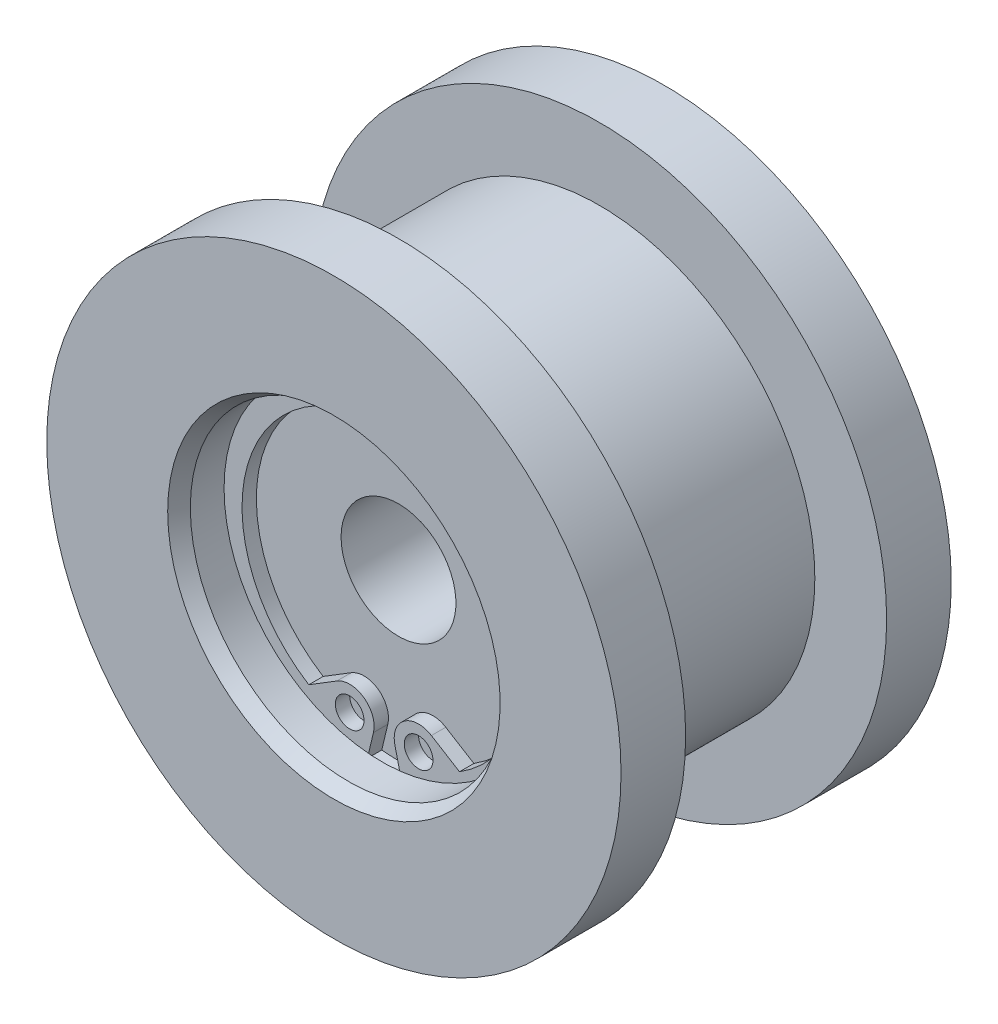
ISO-10303-21;
HEADER;
FILE_DESCRIPTION(('STEP AP214'),'2;1');
FILE_NAME('part.step','',(''),(''),'','','');
FILE_SCHEMA(('AUTOMOTIVE_DESIGN { 1 0 10303 214 1 1 1 1 }'));
ENDSEC;
DATA;
#1=APPLICATION_CONTEXT('core data for automotive mechanical design processes');
#2=APPLICATION_PROTOCOL_DEFINITION('international standard','automotive_design',2000,#1);
#3=PRODUCT_CONTEXT('',#1,'mechanical');
#4=PRODUCT('Part','Part','',(#3));
#5=PRODUCT_RELATED_PRODUCT_CATEGORY('part','',(#4));
#6=PRODUCT_DEFINITION_FORMATION('','',#4);
#7=PRODUCT_DEFINITION_CONTEXT('part definition',#1,'design');
#8=PRODUCT_DEFINITION('design','',#6,#7);
#9=PRODUCT_DEFINITION_SHAPE('','',#8);
#10=(LENGTH_UNIT() NAMED_UNIT(*) SI_UNIT(.MILLI.,.METRE.));
#11=(NAMED_UNIT(*) PLANE_ANGLE_UNIT() SI_UNIT($,.RADIAN.));
#12=(NAMED_UNIT(*) SI_UNIT($,.STERADIAN.) SOLID_ANGLE_UNIT());
#13=UNCERTAINTY_MEASURE_WITH_UNIT(LENGTH_MEASURE(1.E-05),#10,'distance_accuracy_value','');
#14=(GEOMETRIC_REPRESENTATION_CONTEXT(3) GLOBAL_UNCERTAINTY_ASSIGNED_CONTEXT((#13)) GLOBAL_UNIT_ASSIGNED_CONTEXT((#10,
#11,#12)) REPRESENTATION_CONTEXT('',''));
#15=CARTESIAN_POINT('',(0.,0.,0.));
#16=DIRECTION('',(0.,0.,1.));
#17=DIRECTION('',(1.,0.,0.));
#18=AXIS2_PLACEMENT_3D('',#15,#16,#17);
#19=CARTESIAN_POINT('',(0.,4.,7.));
#20=DIRECTION('',(0.,0.,1.));
#21=DIRECTION('',(1.,0.,0.));
#22=AXIS2_PLACEMENT_3D('',#19,#20,#21);
#23=PLANE('',#22);
#24=CARTESIAN_POINT('',(2.4,-9.28614557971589,7.));
#25=DIRECTION('',(0.,0.,1.));
#26=DIRECTION('',(1.,0.,0.));
#27=AXIS2_PLACEMENT_3D('',#24,#25,#26);
#28=CIRCLE('',#27,1.);
#29=CARTESIAN_POINT('',(3.4,-9.28614557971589,7.));
#30=VERTEX_POINT('',#29);
#31=EDGE_CURVE('E571',#30,#30,#28,.T.);
#32=ORIENTED_EDGE('',*,*,#31,.T.);
#33=EDGE_LOOP('',(#32));
#34=FACE_BOUND('',#33,.T.);
#35=ADVANCED_FACE('F14',(#34),#23,.T.);
#36=CARTESIAN_POINT('',(-2.4,-9.28614557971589,7.));
#37=DIRECTION('',(0.,0.,-1.));
#38=DIRECTION('',(1.,0.,0.));
#39=AXIS2_PLACEMENT_3D('',#36,#37,#38);
#40=CIRCLE('',#39,1.);
#41=CARTESIAN_POINT('',(-1.4,-9.28614557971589,7.));
#42=VERTEX_POINT('',#41);
#43=EDGE_CURVE('E130',#42,#42,#40,.T.);
#44=ORIENTED_EDGE('',*,*,#43,.F.);
#45=EDGE_LOOP('',(#44));
#46=FACE_BOUND('',#45,.T.);
#47=ADVANCED_FACE('F204',(#46),#23,.T.);
#48=CARTESIAN_POINT('',(0.,0.,-11.5));
#49=DIRECTION('',(0.,0.,-1.));
#50=DIRECTION('',(-1.,0.,0.));
#51=AXIS2_PLACEMENT_3D('',#48,#49,#50);
#52=CYLINDRICAL_SURFACE('',#51,15.);
#53=CARTESIAN_POINT('',(0.,0.,7.));
#54=DIRECTION('',(0.,0.,-1.));
#55=DIRECTION('',(-1.,0.,0.));
#56=AXIS2_PLACEMENT_3D('',#53,#54,#55);
#57=CIRCLE('',#56,15.);
#58=CARTESIAN_POINT('',(-15.,0.,7.));
#59=VERTEX_POINT('',#58);
#60=EDGE_CURVE('E176',#59,#59,#57,.T.);
#61=ORIENTED_EDGE('',*,*,#60,.T.);
#62=EDGE_LOOP('',(#61));
#63=FACE_BOUND('',#62,.T.);
#64=CARTESIAN_POINT('',(0.,0.,-7.));
#65=DIRECTION('',(0.,0.,-1.));
#66=DIRECTION('',(-1.,0.,0.));
#67=AXIS2_PLACEMENT_3D('',#64,#65,#66);
#68=CIRCLE('',#67,15.);
#69=CARTESIAN_POINT('',(-15.,0.,-7.));
#70=VERTEX_POINT('',#69);
#71=EDGE_CURVE('E179',#70,#70,#68,.T.);
#72=ORIENTED_EDGE('',*,*,#71,.F.);
#73=EDGE_LOOP('',(#72));
#74=FACE_BOUND('',#73,.T.);
#75=ADVANCED_FACE('F199',(#63,#74),#52,.T.);
#76=CARTESIAN_POINT('',(0.,15.,7.));
#77=DIRECTION('',(0.,0.,-1.));
#78=DIRECTION('',(-1.,0.,0.));
#79=AXIS2_PLACEMENT_3D('',#76,#77,#78);
#80=PLANE('',#79);
#81=CARTESIAN_POINT('',(0.,0.,7.));
#82=DIRECTION('',(0.,0.,-1.));
#83=DIRECTION('',(-1.,0.,0.));
#84=AXIS2_PLACEMENT_3D('',#81,#82,#83);
#85=CIRCLE('',#84,20.);
#86=CARTESIAN_POINT('',(-20.,0.,7.));
#87=VERTEX_POINT('',#86);
#88=EDGE_CURVE('E173',#87,#87,#85,.T.);
#89=ORIENTED_EDGE('',*,*,#88,.T.);
#90=EDGE_LOOP('',(#89));
#91=FACE_BOUND('',#90,.T.);
#92=ORIENTED_EDGE('',*,*,#60,.F.);
#93=EDGE_LOOP('',(#92));
#94=FACE_BOUND('',#93,.T.);
#95=ADVANCED_FACE('F190',(#91,#94),#80,.T.);
#96=CARTESIAN_POINT('',(0.,20.,-7.));
#97=DIRECTION('',(0.,0.,1.));
#98=DIRECTION('',(1.,0.,0.));
#99=AXIS2_PLACEMENT_3D('',#96,#97,#98);
#100=PLANE('',#99);
#101=ORIENTED_EDGE('',*,*,#71,.T.);
#102=EDGE_LOOP('',(#101));
#103=FACE_BOUND('',#102,.T.);
#104=CARTESIAN_POINT('',(0.,0.,-7.));
#105=DIRECTION('',(0.,0.,-1.));
#106=DIRECTION('',(-1.,0.,0.));
#107=AXIS2_PLACEMENT_3D('',#104,#105,#106);
#108=CIRCLE('',#107,20.);
#109=CARTESIAN_POINT('',(-20.,0.,-7.));
#110=VERTEX_POINT('',#109);
#111=EDGE_CURVE('E131',#110,#110,#108,.T.);
#112=ORIENTED_EDGE('',*,*,#111,.F.);
#113=EDGE_LOOP('',(#112));
#114=FACE_BOUND('',#113,.T.);
#115=ADVANCED_FACE('F187',(#103,#114),#100,.T.);
#116=CARTESIAN_POINT('',(0.,0.,-11.5));
#117=DIRECTION('',(0.,0.,-1.));
#118=DIRECTION('',(-1.,0.,0.));
#119=AXIS2_PLACEMENT_3D('',#116,#117,#118);
#120=CYLINDRICAL_SURFACE('',#119,20.);
#121=CARTESIAN_POINT('',(0.,0.,11.5));
#122=DIRECTION('',(0.,0.,-1.));
#123=DIRECTION('',(-1.,0.,0.));
#124=AXIS2_PLACEMENT_3D('',#121,#122,#123);
#125=CIRCLE('',#124,20.);
#126=CARTESIAN_POINT('',(-20.,0.,11.5));
#127=VERTEX_POINT('',#126);
#128=EDGE_CURVE('E170',#127,#127,#125,.T.);
#129=ORIENTED_EDGE('',*,*,#128,.T.);
#130=EDGE_LOOP('',(#129));
#131=FACE_BOUND('',#130,.T.);
#132=ORIENTED_EDGE('',*,*,#88,.F.);
#133=EDGE_LOOP('',(#132));
#134=FACE_BOUND('',#133,.T.);
#135=ADVANCED_FACE('F189',(#131,#134),#120,.T.);
#136=CARTESIAN_POINT('',(0.,0.,-11.5));
#137=DIRECTION('',(0.,0.,-1.));
#138=DIRECTION('',(-1.,0.,0.));
#139=AXIS2_PLACEMENT_3D('',#136,#137,#138);
#140=CYLINDRICAL_SURFACE('',#139,20.);
#141=ORIENTED_EDGE('',*,*,#111,.T.);
#142=EDGE_LOOP('',(#141));
#143=FACE_BOUND('',#142,.T.);
#144=CARTESIAN_POINT('',(0.,0.,-11.5));
#145=DIRECTION('',(0.,0.,-1.));
#146=DIRECTION('',(-1.,0.,0.));
#147=AXIS2_PLACEMENT_3D('',#144,#145,#146);
#148=CIRCLE('',#147,20.);
#149=CARTESIAN_POINT('',(-20.,0.,-11.5));
#150=VERTEX_POINT('',#149);
#151=EDGE_CURVE('E142',#150,#150,#148,.T.);
#152=ORIENTED_EDGE('',*,*,#151,.F.);
#153=EDGE_LOOP('',(#152));
#154=FACE_BOUND('',#153,.T.);
#155=ADVANCED_FACE('F16',(#143,#154),#140,.T.);
#156=CARTESIAN_POINT('',(0.,20.,11.5));
#157=DIRECTION('',(0.,0.,1.));
#158=DIRECTION('',(1.,0.,0.));
#159=AXIS2_PLACEMENT_3D('',#156,#157,#158);
#160=PLANE('',#159);
#161=CARTESIAN_POINT('',(0.,0.,11.5));
#162=DIRECTION('',(0.,0.,-1.));
#163=DIRECTION('',(-1.,0.,0.));
#164=AXIS2_PLACEMENT_3D('',#161,#162,#163);
#165=CIRCLE('',#164,11.5773502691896);
#166=CARTESIAN_POINT('',(-11.5773502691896,0.,11.5));
#167=VERTEX_POINT('',#166);
#168=EDGE_CURVE('E167',#167,#167,#165,.T.);
#169=ORIENTED_EDGE('',*,*,#168,.T.);
#170=EDGE_LOOP('',(#169));
#171=FACE_BOUND('',#170,.T.);
#172=ORIENTED_EDGE('',*,*,#128,.F.);
#173=EDGE_LOOP('',(#172));
#174=FACE_BOUND('',#173,.T.);
#175=ADVANCED_FACE('F260',(#171,#174),#160,.T.);
#176=CARTESIAN_POINT('',(0.,9.,-11.5));
#177=DIRECTION('',(0.,0.,-1.));
#178=DIRECTION('',(-1.,0.,0.));
#179=AXIS2_PLACEMENT_3D('',#176,#177,#178);
#180=PLANE('',#179);
#181=ORIENTED_EDGE('',*,*,#151,.T.);
#182=EDGE_LOOP('',(#181));
#183=FACE_BOUND('',#182,.T.);
#184=CARTESIAN_POINT('',(0.,0.,-11.5));
#185=DIRECTION('',(0.,0.,-1.));
#186=DIRECTION('',(-1.,0.,0.));
#187=AXIS2_PLACEMENT_3D('',#184,#185,#186);
#188=CIRCLE('',#187,9.);
#189=CARTESIAN_POINT('',(-9.,0.,-11.5));
#190=VERTEX_POINT('',#189);
#191=EDGE_CURVE('E145',#190,#190,#188,.T.);
#192=ORIENTED_EDGE('',*,*,#191,.F.);
#193=EDGE_LOOP('',(#192));
#194=FACE_BOUND('',#193,.T.);
#195=ADVANCED_FACE('F256',(#183,#194),#180,.T.);
#196=CARTESIAN_POINT('',(0.,0.,11.5));
#197=DIRECTION('',(0.,0.,1.));
#198=DIRECTION('',(1.,0.,0.));
#199=AXIS2_PLACEMENT_3D('',#196,#197,#198);
#200=CONICAL_SURFACE('',#199,11.5773502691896,0.523598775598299);
#201=CARTESIAN_POINT('',(0.,0.,10.5));
#202=DIRECTION('',(0.,0.,-1.));
#203=DIRECTION('',(-1.,0.,0.));
#204=AXIS2_PLACEMENT_3D('',#201,#202,#203);
#205=CIRCLE('',#204,11.);
#206=CARTESIAN_POINT('',(-11.,0.,10.5));
#207=VERTEX_POINT('',#206);
#208=EDGE_CURVE('E164',#207,#207,#205,.T.);
#209=ORIENTED_EDGE('',*,*,#208,.T.);
#210=EDGE_LOOP('',(#209));
#211=FACE_BOUND('',#210,.T.);
#212=ORIENTED_EDGE('',*,*,#168,.F.);
#213=EDGE_LOOP('',(#212));
#214=FACE_BOUND('',#213,.T.);
#215=ADVANCED_FACE('F259',(#211,#214),#200,.F.);
#216=CARTESIAN_POINT('',(0.,0.,-11.5));
#217=DIRECTION('',(0.,0.,-1.));
#218=DIRECTION('',(-1.,0.,0.));
#219=AXIS2_PLACEMENT_3D('',#216,#217,#218);
#220=CYLINDRICAL_SURFACE('',#219,9.);
#221=ORIENTED_EDGE('',*,*,#191,.T.);
#222=EDGE_LOOP('',(#221));
#223=FACE_BOUND('',#222,.T.);
#224=CARTESIAN_POINT('',(0.,0.,-7.));
#225=DIRECTION('',(0.,0.,-1.));
#226=DIRECTION('',(-1.,0.,0.));
#227=AXIS2_PLACEMENT_3D('',#224,#225,#226);
#228=CIRCLE('',#227,9.);
#229=CARTESIAN_POINT('',(-9.,0.,-7.));
#230=VERTEX_POINT('',#229);
#231=EDGE_CURVE('E148',#230,#230,#228,.T.);
#232=ORIENTED_EDGE('',*,*,#231,.F.);
#233=EDGE_LOOP('',(#232));
#234=FACE_BOUND('',#233,.T.);
#235=ADVANCED_FACE('F262',(#223,#234),#220,.F.);
#236=CARTESIAN_POINT('',(0.,0.,-11.5));
#237=DIRECTION('',(0.,0.,-1.));
#238=DIRECTION('',(-1.,0.,0.));
#239=AXIS2_PLACEMENT_3D('',#236,#237,#238);
#240=CYLINDRICAL_SURFACE('',#239,11.);
#241=CARTESIAN_POINT('',(0.,0.,8.15));
#242=DIRECTION('',(0.,0.,-1.));
#243=DIRECTION('',(-1.,0.,0.));
#244=AXIS2_PLACEMENT_3D('',#241,#242,#243);
#245=CIRCLE('',#244,11.);
#246=CARTESIAN_POINT('',(-11.,0.,8.15));
#247=VERTEX_POINT('',#246);
#248=EDGE_CURVE('E161',#247,#247,#245,.T.);
#249=ORIENTED_EDGE('',*,*,#248,.T.);
#250=EDGE_LOOP('',(#249));
#251=FACE_BOUND('',#250,.T.);
#252=ORIENTED_EDGE('',*,*,#208,.F.);
#253=EDGE_LOOP('',(#252));
#254=FACE_BOUND('',#253,.T.);
#255=ADVANCED_FACE('F265',(#251,#254),#240,.F.);
#256=CARTESIAN_POINT('',(0.,9.,-7.));
#257=DIRECTION('',(0.,0.,-1.));
#258=DIRECTION('',(-1.,0.,0.));
#259=AXIS2_PLACEMENT_3D('',#256,#257,#258);
#260=PLANE('',#259);
#261=ORIENTED_EDGE('',*,*,#231,.T.);
#262=EDGE_LOOP('',(#261));
#263=FACE_BOUND('',#262,.T.);
#264=CARTESIAN_POINT('',(0.,0.,-7.));
#265=DIRECTION('',(0.,0.,-1.));
#266=DIRECTION('',(-1.,0.,0.));
#267=AXIS2_PLACEMENT_3D('',#264,#265,#266);
#268=CIRCLE('',#267,4.);
#269=CARTESIAN_POINT('',(-4.,0.,-7.));
#270=VERTEX_POINT('',#269);
#271=EDGE_CURVE('E151',#270,#270,#268,.T.);
#272=ORIENTED_EDGE('',*,*,#271,.F.);
#273=EDGE_LOOP('',(#272));
#274=FACE_BOUND('',#273,.T.);
#275=ADVANCED_FACE('F267',(#263,#274),#260,.T.);
#276=CARTESIAN_POINT('',(0.,11.5,8.15));
#277=DIRECTION('',(0.,0.,-1.));
#278=DIRECTION('',(-1.,0.,0.));
#279=AXIS2_PLACEMENT_3D('',#276,#277,#278);
#280=PLANE('',#279);
#281=CARTESIAN_POINT('',(0.,0.,8.15));
#282=DIRECTION('',(0.,0.,-1.));
#283=DIRECTION('',(-1.,0.,0.));
#284=AXIS2_PLACEMENT_3D('',#281,#282,#283);
#285=CIRCLE('',#284,11.5);
#286=CARTESIAN_POINT('',(-11.5,0.,8.15));
#287=VERTEX_POINT('',#286);
#288=EDGE_CURVE('E158',#287,#287,#285,.T.);
#289=ORIENTED_EDGE('',*,*,#288,.T.);
#290=EDGE_LOOP('',(#289));
#291=FACE_BOUND('',#290,.T.);
#292=ORIENTED_EDGE('',*,*,#248,.F.);
#293=EDGE_LOOP('',(#292));
#294=FACE_BOUND('',#293,.T.);
#295=ADVANCED_FACE('F269',(#291,#294),#280,.T.);
#296=CARTESIAN_POINT('',(0.,0.,-11.5));
#297=DIRECTION('',(0.,0.,-1.));
#298=DIRECTION('',(-1.,0.,0.));
#299=AXIS2_PLACEMENT_3D('',#296,#297,#298);
#300=CYLINDRICAL_SURFACE('',#299,11.5);
#301=ORIENTED_EDGE('',*,*,#288,.F.);
#302=EDGE_LOOP('',(#301));
#303=FACE_BOUND('',#302,.T.);
#304=DIRECTION('',(0.,0.,-1.));
#305=VECTOR('',#304,1.);
#306=CARTESIAN_POINT('',(1.16498191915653,-11.440839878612,-11.5));
#307=LINE('',#306,#305);
#308=CARTESIAN_POINT('',(1.16498191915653,-11.440839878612,7.));
#309=VERTEX_POINT('',#308);
#310=CARTESIAN_POINT('',(1.16498191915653,-11.440839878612,8.));
#311=VERTEX_POINT('',#310);
#312=EDGE_CURVE('E18',#309,#311,#307,.F.);
#313=ORIENTED_EDGE('',*,*,#312,.F.);
#314=CARTESIAN_POINT('',(0.,0.,7.));
#315=DIRECTION('',(0.,0.,-1.));
#316=DIRECTION('',(-1.,0.,0.));
#317=AXIS2_PLACEMENT_3D('',#314,#315,#316);
#318=CIRCLE('',#317,11.5);
#319=CARTESIAN_POINT('',(-1.16498191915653,-11.440839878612,7.));
#320=VERTEX_POINT('',#319);
#321=EDGE_CURVE('E107',#309,#320,#318,.T.);
#322=ORIENTED_EDGE('',*,*,#321,.T.);
#323=DIRECTION('',(0.,0.,-1.));
#324=VECTOR('',#323,1.);
#325=CARTESIAN_POINT('',(-1.16498191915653,-11.440839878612,-11.5));
#326=LINE('',#325,#324);
#327=CARTESIAN_POINT('',(-1.16498191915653,-11.440839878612,8.));
#328=VERTEX_POINT('',#327);
#329=EDGE_CURVE('E138',#328,#320,#326,.T.);
#330=ORIENTED_EDGE('',*,*,#329,.F.);
#331=CARTESIAN_POINT('',(0.,0.,8.));
#332=DIRECTION('',(0.,0.,-1.));
#333=DIRECTION('',(-1.,0.,0.));
#334=AXIS2_PLACEMENT_3D('',#331,#332,#333);
#335=CIRCLE('',#334,11.5);
#336=EDGE_CURVE('E9',#311,#328,#335,.F.);
#337=ORIENTED_EDGE('',*,*,#336,.F.);
#338=EDGE_LOOP('',(#313,#322,#330,#337));
#339=FACE_BOUND('',#338,.T.);
#340=ADVANCED_FACE('F272',(#303,#339),#300,.F.);
#341=CARTESIAN_POINT('',(0.,0.,-11.5));
#342=DIRECTION('',(0.,0.,-1.));
#343=DIRECTION('',(-1.,0.,0.));
#344=AXIS2_PLACEMENT_3D('',#341,#342,#343);
#345=CYLINDRICAL_SURFACE('',#344,4.);
#346=ORIENTED_EDGE('',*,*,#271,.T.);
#347=EDGE_LOOP('',(#346));
#348=FACE_BOUND('',#347,.T.);
#349=CARTESIAN_POINT('',(0.,0.,7.));
#350=DIRECTION('',(0.,0.,-1.));
#351=DIRECTION('',(-1.,0.,0.));
#352=AXIS2_PLACEMENT_3D('',#349,#350,#351);
#353=CIRCLE('',#352,4.);
#354=CARTESIAN_POINT('',(-4.,0.,7.));
#355=VERTEX_POINT('',#354);
#356=EDGE_CURVE('E154',#355,#355,#353,.T.);
#357=ORIENTED_EDGE('',*,*,#356,.F.);
#358=EDGE_LOOP('',(#357));
#359=FACE_BOUND('',#358,.T.);
#360=ADVANCED_FACE('F216',(#348,#359),#345,.F.);
#361=ORIENTED_EDGE('',*,*,#356,.T.);
#362=EDGE_LOOP('',(#361));
#363=FACE_BOUND('',#362,.T.);
#364=DIRECTION('',(0.231349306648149,-0.972870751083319,0.));
#365=VECTOR('',#364,1.);
#366=CARTESIAN_POINT('',(0.746119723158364,-9.67943940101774,7.));
#367=LINE('',#366,#365);
#368=CARTESIAN_POINT('',(0.746119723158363,-9.67943940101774,7.));
#369=VERTEX_POINT('',#368);
#370=EDGE_CURVE('E34',#369,#309,#367,.T.);
#371=ORIENTED_EDGE('',*,*,#370,.F.);
#372=CARTESIAN_POINT('',(2.4,-9.28614557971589,7.));
#373=DIRECTION('',(0.,0.,1.));
#374=DIRECTION('',(1.,0.,0.));
#375=AXIS2_PLACEMENT_3D('',#372,#373,#374);
#376=CIRCLE('',#375,1.7);
#377=CARTESIAN_POINT('',(3.29136923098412,-7.83857489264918,7.));
#378=VERTEX_POINT('',#377);
#379=EDGE_CURVE('E94',#378,#369,#376,.T.);
#380=ORIENTED_EDGE('',*,*,#379,.F.);
#381=DIRECTION('',(-0.851512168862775,0.524334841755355,0.));
#382=VECTOR('',#381,1.);
#383=CARTESIAN_POINT('',(3.29136923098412,-7.83857489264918,7.));
#384=LINE('',#383,#382);
#385=CARTESIAN_POINT('',(5.2489218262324,-9.04397520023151,7.));
#386=VERTEX_POINT('',#385);
#387=EDGE_CURVE('E136',#386,#378,#384,.T.);
#388=ORIENTED_EDGE('',*,*,#387,.F.);
#389=CARTESIAN_POINT('',(0.,-0.65,7.));
#390=DIRECTION('',(0.,0.,-1.));
#391=DIRECTION('',(0.,-1.,0.));
#392=AXIS2_PLACEMENT_3D('',#389,#390,#391);
#393=CIRCLE('',#392,9.9);
#394=CARTESIAN_POINT('',(-5.24892182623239,-9.04397520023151,7.));
#395=VERTEX_POINT('',#394);
#396=EDGE_CURVE('E575',#395,#386,#393,.T.);
#397=ORIENTED_EDGE('',*,*,#396,.F.);
#398=DIRECTION('',(-0.851512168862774,-0.524334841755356,0.));
#399=VECTOR('',#398,1.);
#400=CARTESIAN_POINT('',(-3.29136923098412,-7.83857489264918,7.));
#401=LINE('',#400,#399);
#402=CARTESIAN_POINT('',(-3.29136923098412,-7.83857489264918,7.));
#403=VERTEX_POINT('',#402);
#404=EDGE_CURVE('E141',#403,#395,#401,.T.);
#405=ORIENTED_EDGE('',*,*,#404,.F.);
#406=CARTESIAN_POINT('',(-2.4,-9.28614557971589,7.));
#407=DIRECTION('',(0.,0.,1.));
#408=DIRECTION('',(-1.,0.,0.));
#409=AXIS2_PLACEMENT_3D('',#406,#407,#408);
#410=CIRCLE('',#409,1.7);
#411=CARTESIAN_POINT('',(-0.746119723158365,-9.67943940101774,7.));
#412=VERTEX_POINT('',#411);
#413=EDGE_CURVE('E121',#412,#403,#410,.T.);
#414=ORIENTED_EDGE('',*,*,#413,.F.);
#415=DIRECTION('',(0.231349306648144,0.97287075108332,0.));
#416=VECTOR('',#415,1.);
#417=CARTESIAN_POINT('',(-0.746119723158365,-9.67943940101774,7.));
#418=LINE('',#417,#416);
#419=EDGE_CURVE('E115',#320,#412,#418,.T.);
#420=ORIENTED_EDGE('',*,*,#419,.F.);
#421=ORIENTED_EDGE('',*,*,#321,.F.);
#422=EDGE_LOOP('',(#371,#380,#388,#397,#405,#414,#420,#421));
#423=FACE_BOUND('',#422,.T.);
#424=ADVANCED_FACE('F105',(#363,#423),#23,.T.);
#425=CARTESIAN_POINT('',(0.,-0.65,8.));
#426=DIRECTION('',(0.,0.,1.));
#427=DIRECTION('',(-1.,0.,0.));
#428=AXIS2_PLACEMENT_3D('',#425,#426,#427);
#429=CYLINDRICAL_SURFACE('',#428,9.9);
#430=ORIENTED_EDGE('',*,*,#396,.T.);
#431=DIRECTION('',(0.,0.,-1.));
#432=VECTOR('',#431,1.);
#433=CARTESIAN_POINT('',(5.2489218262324,-9.04397520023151,8.));
#434=LINE('',#433,#432);
#435=CARTESIAN_POINT('',(5.2489218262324,-9.04397520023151,8.));
#436=VERTEX_POINT('',#435);
#437=EDGE_CURVE('E132',#436,#386,#434,.T.);
#438=ORIENTED_EDGE('',*,*,#437,.F.);
#439=CARTESIAN_POINT('',(0.,-0.65,8.));
#440=DIRECTION('',(0.,0.,-1.));
#441=DIRECTION('',(0.,-1.,0.));
#442=AXIS2_PLACEMENT_3D('',#439,#440,#441);
#443=CIRCLE('',#442,9.9);
#444=CARTESIAN_POINT('',(-5.24892182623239,-9.04397520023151,8.));
#445=VERTEX_POINT('',#444);
#446=EDGE_CURVE('E549',#445,#436,#443,.T.);
#447=ORIENTED_EDGE('',*,*,#446,.F.);
#448=DIRECTION('',(0.,0.,-1.));
#449=VECTOR('',#448,1.);
#450=CARTESIAN_POINT('',(-5.24892182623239,-9.04397520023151,8.));
#451=LINE('',#450,#449);
#452=EDGE_CURVE('E125',#445,#395,#451,.T.);
#453=ORIENTED_EDGE('',*,*,#452,.T.);
#454=EDGE_LOOP('',(#430,#438,#447,#453));
#455=FACE_BOUND('',#454,.T.);
#456=ADVANCED_FACE('F207',(#455),#429,.F.);
#457=CARTESIAN_POINT('',(3.29136923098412,-7.83857489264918,8.));
#458=DIRECTION('',(-0.524334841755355,-0.851512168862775,0.));
#459=DIRECTION('',(-0.851512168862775,0.524334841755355,0.));
#460=AXIS2_PLACEMENT_3D('',#457,#458,#459);
#461=PLANE('',#460);
#462=ORIENTED_EDGE('',*,*,#387,.T.);
#463=DIRECTION('',(0.,0.,-1.));
#464=VECTOR('',#463,1.);
#465=CARTESIAN_POINT('',(3.29136923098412,-7.83857489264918,8.));
#466=LINE('',#465,#464);
#467=CARTESIAN_POINT('',(3.29136923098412,-7.83857489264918,8.));
#468=VERTEX_POINT('',#467);
#469=EDGE_CURVE('E98',#468,#378,#466,.T.);
#470=ORIENTED_EDGE('',*,*,#469,.F.);
#471=DIRECTION('',(-0.851512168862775,0.524334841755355,0.));
#472=VECTOR('',#471,1.);
#473=CARTESIAN_POINT('',(3.29136923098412,-7.83857489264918,8.));
#474=LINE('',#473,#472);
#475=EDGE_CURVE('E552',#436,#468,#474,.T.);
#476=ORIENTED_EDGE('',*,*,#475,.F.);
#477=ORIENTED_EDGE('',*,*,#437,.T.);
#478=EDGE_LOOP('',(#462,#470,#476,#477));
#479=FACE_BOUND('',#478,.T.);
#480=ADVANCED_FACE('F219',(#479),#461,.F.);
#481=CARTESIAN_POINT('',(2.4,-9.28614557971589,8.));
#482=DIRECTION('',(0.,0.,1.));
#483=DIRECTION('',(-1.,0.,0.));
#484=AXIS2_PLACEMENT_3D('',#481,#482,#483);
#485=CYLINDRICAL_SURFACE('',#484,1.7);
#486=ORIENTED_EDGE('',*,*,#379,.T.);
#487=DIRECTION('',(0.,0.,-1.));
#488=VECTOR('',#487,1.);
#489=CARTESIAN_POINT('',(0.746119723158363,-9.67943940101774,8.));
#490=LINE('',#489,#488);
#491=CARTESIAN_POINT('',(0.746119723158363,-9.67943940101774,8.));
#492=VERTEX_POINT('',#491);
#493=EDGE_CURVE('E97',#492,#369,#490,.T.);
#494=ORIENTED_EDGE('',*,*,#493,.F.);
#495=CARTESIAN_POINT('',(2.4,-9.28614557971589,8.));
#496=DIRECTION('',(0.,0.,1.));
#497=DIRECTION('',(1.,0.,0.));
#498=AXIS2_PLACEMENT_3D('',#495,#496,#497);
#499=CIRCLE('',#498,1.7);
#500=EDGE_CURVE('E537',#468,#492,#499,.T.);
#501=ORIENTED_EDGE('',*,*,#500,.F.);
#502=ORIENTED_EDGE('',*,*,#469,.T.);
#503=EDGE_LOOP('',(#486,#494,#501,#502));
#504=FACE_BOUND('',#503,.T.);
#505=ADVANCED_FACE('F95',(#504),#485,.T.);
#506=CARTESIAN_POINT('',(-0.746119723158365,-9.67943940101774,8.));
#507=DIRECTION('',(-0.97287075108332,0.231349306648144,0.));
#508=DIRECTION('',(0.,0.,1.));
#509=AXIS2_PLACEMENT_3D('',#506,#507,#508);
#510=PLANE('',#509);
#511=DIRECTION('',(0.231349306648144,0.97287075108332,0.));
#512=VECTOR('',#511,1.);
#513=CARTESIAN_POINT('',(-0.746119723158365,-9.67943940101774,8.));
#514=LINE('',#513,#512);
#515=CARTESIAN_POINT('',(-0.746119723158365,-9.67943940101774,8.));
#516=VERTEX_POINT('',#515);
#517=EDGE_CURVE('E480',#328,#516,#514,.T.);
#518=ORIENTED_EDGE('',*,*,#517,.F.);
#519=ORIENTED_EDGE('',*,*,#329,.T.);
#520=ORIENTED_EDGE('',*,*,#419,.T.);
#521=DIRECTION('',(0.,0.,-1.));
#522=VECTOR('',#521,1.);
#523=CARTESIAN_POINT('',(-0.746119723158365,-9.67943940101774,8.));
#524=LINE('',#523,#522);
#525=EDGE_CURVE('E556',#516,#412,#524,.T.);
#526=ORIENTED_EDGE('',*,*,#525,.F.);
#527=EDGE_LOOP('',(#518,#519,#520,#526));
#528=FACE_BOUND('',#527,.T.);
#529=ADVANCED_FACE('F244',(#528),#510,.F.);
#530=CARTESIAN_POINT('',(0.,-0.65,8.));
#531=DIRECTION('',(0.,0.,-1.));
#532=DIRECTION('',(0.,-1.,0.));
#533=AXIS2_PLACEMENT_3D('',#530,#531,#532);
#534=PLANE('',#533);
#535=CARTESIAN_POINT('',(-2.4,-9.28614557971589,8.));
#536=DIRECTION('',(0.,0.,-1.));
#537=DIRECTION('',(1.,0.,0.));
#538=AXIS2_PLACEMENT_3D('',#535,#536,#537);
#539=CIRCLE('',#538,1.);
#540=CARTESIAN_POINT('',(-1.4,-9.28614557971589,8.));
#541=VERTEX_POINT('',#540);
#542=EDGE_CURVE('E102',#541,#541,#539,.T.);
#543=ORIENTED_EDGE('',*,*,#542,.T.);
#544=EDGE_LOOP('',(#543));
#545=FACE_BOUND('',#544,.T.);
#546=CARTESIAN_POINT('',(2.4,-9.28614557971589,8.));
#547=DIRECTION('',(0.,0.,1.));
#548=DIRECTION('',(1.,0.,0.));
#549=AXIS2_PLACEMENT_3D('',#546,#547,#548);
#550=CIRCLE('',#549,1.);
#551=CARTESIAN_POINT('',(3.4,-9.28614557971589,8.));
#552=VERTEX_POINT('',#551);
#553=EDGE_CURVE('E127',#552,#552,#550,.T.);
#554=ORIENTED_EDGE('',*,*,#553,.F.);
#555=EDGE_LOOP('',(#554));
#556=FACE_BOUND('',#555,.T.);
#557=DIRECTION('',(0.231349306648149,-0.972870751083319,0.));
#558=VECTOR('',#557,1.);
#559=CARTESIAN_POINT('',(0.746119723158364,-9.67943940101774,8.));
#560=LINE('',#559,#558);
#561=EDGE_CURVE('E112',#492,#311,#560,.T.);
#562=ORIENTED_EDGE('',*,*,#561,.T.);
#563=ORIENTED_EDGE('',*,*,#336,.T.);
#564=ORIENTED_EDGE('',*,*,#517,.T.);
#565=CARTESIAN_POINT('',(-2.4,-9.28614557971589,8.));
#566=DIRECTION('',(0.,0.,1.));
#567=DIRECTION('',(-1.,0.,0.));
#568=AXIS2_PLACEMENT_3D('',#565,#566,#567);
#569=CIRCLE('',#568,1.7);
#570=CARTESIAN_POINT('',(-3.29136923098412,-7.83857489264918,8.));
#571=VERTEX_POINT('',#570);
#572=EDGE_CURVE('E482',#516,#571,#569,.T.);
#573=ORIENTED_EDGE('',*,*,#572,.T.);
#574=DIRECTION('',(-0.851512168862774,-0.524334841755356,0.));
#575=VECTOR('',#574,1.);
#576=CARTESIAN_POINT('',(-3.29136923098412,-7.83857489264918,8.));
#577=LINE('',#576,#575);
#578=EDGE_CURVE('E137',#571,#445,#577,.T.);
#579=ORIENTED_EDGE('',*,*,#578,.T.);
#580=ORIENTED_EDGE('',*,*,#446,.T.);
#581=ORIENTED_EDGE('',*,*,#475,.T.);
#582=ORIENTED_EDGE('',*,*,#500,.T.);
#583=EDGE_LOOP('',(#562,#563,#564,#573,#579,#580,#581,#582));
#584=FACE_BOUND('',#583,.T.);
#585=ADVANCED_FACE('F236',(#545,#556,#584),#534,.F.);
#586=CARTESIAN_POINT('',(2.4,-9.28614557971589,8.));
#587=DIRECTION('',(0.,0.,1.));
#588=DIRECTION('',(-1.,0.,0.));
#589=AXIS2_PLACEMENT_3D('',#586,#587,#588);
#590=CYLINDRICAL_SURFACE('',#589,1.);
#591=ORIENTED_EDGE('',*,*,#31,.F.);
#592=EDGE_LOOP('',(#591));
#593=FACE_BOUND('',#592,.T.);
#594=ORIENTED_EDGE('',*,*,#553,.T.);
#595=EDGE_LOOP('',(#594));
#596=FACE_BOUND('',#595,.T.);
#597=ADVANCED_FACE('F232',(#593,#596),#590,.F.);
#598=CARTESIAN_POINT('',(-2.4,-9.28614557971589,8.));
#599=DIRECTION('',(0.,0.,1.));
#600=DIRECTION('',(-1.,0.,0.));
#601=AXIS2_PLACEMENT_3D('',#598,#599,#600);
#602=CYLINDRICAL_SURFACE('',#601,1.);
#603=ORIENTED_EDGE('',*,*,#43,.T.);
#604=EDGE_LOOP('',(#603));
#605=FACE_BOUND('',#604,.T.);
#606=ORIENTED_EDGE('',*,*,#542,.F.);
#607=EDGE_LOOP('',(#606));
#608=FACE_BOUND('',#607,.T.);
#609=ADVANCED_FACE('F228',(#605,#608),#602,.F.);
#610=CARTESIAN_POINT('',(-3.29136923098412,-7.83857489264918,8.));
#611=DIRECTION('',(0.524334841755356,-0.851512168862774,0.));
#612=DIRECTION('',(0.,0.,-1.));
#613=AXIS2_PLACEMENT_3D('',#610,#611,#612);
#614=PLANE('',#613);
#615=ORIENTED_EDGE('',*,*,#404,.T.);
#616=ORIENTED_EDGE('',*,*,#452,.F.);
#617=ORIENTED_EDGE('',*,*,#578,.F.);
#618=DIRECTION('',(0.,0.,-1.));
#619=VECTOR('',#618,1.);
#620=CARTESIAN_POINT('',(-3.29136923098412,-7.83857489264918,8.));
#621=LINE('',#620,#619);
#622=EDGE_CURVE('E564',#571,#403,#621,.T.);
#623=ORIENTED_EDGE('',*,*,#622,.T.);
#624=EDGE_LOOP('',(#615,#616,#617,#623));
#625=FACE_BOUND('',#624,.T.);
#626=ADVANCED_FACE('F231',(#625),#614,.F.);
#627=CARTESIAN_POINT('',(-2.4,-9.28614557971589,8.));
#628=DIRECTION('',(0.,0.,1.));
#629=DIRECTION('',(-1.,0.,0.));
#630=AXIS2_PLACEMENT_3D('',#627,#628,#629);
#631=CYLINDRICAL_SURFACE('',#630,1.7);
#632=ORIENTED_EDGE('',*,*,#413,.T.);
#633=ORIENTED_EDGE('',*,*,#622,.F.);
#634=ORIENTED_EDGE('',*,*,#572,.F.);
#635=ORIENTED_EDGE('',*,*,#525,.T.);
#636=EDGE_LOOP('',(#632,#633,#634,#635));
#637=FACE_BOUND('',#636,.T.);
#638=ADVANCED_FACE('F238',(#637),#631,.T.);
#639=CARTESIAN_POINT('',(0.746119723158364,-9.67943940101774,8.));
#640=DIRECTION('',(0.972870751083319,0.231349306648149,0.));
#641=DIRECTION('',(0.,0.,-1.));
#642=AXIS2_PLACEMENT_3D('',#639,#640,#641);
#643=PLANE('',#642);
#644=ORIENTED_EDGE('',*,*,#370,.T.);
#645=ORIENTED_EDGE('',*,*,#312,.T.);
#646=ORIENTED_EDGE('',*,*,#561,.F.);
#647=ORIENTED_EDGE('',*,*,#493,.T.);
#648=EDGE_LOOP('',(#644,#645,#646,#647));
#649=FACE_BOUND('',#648,.T.);
#650=ADVANCED_FACE('F110',(#649),#643,.F.);
#651=CLOSED_SHELL('',(#35,#47,#75,#95,#115,#135,#155,#175,#195,#215,#235,#255,#275,#295,#340,
#360,#424,#456,#480,#505,#529,#585,#597,#609,#626,#638,#650));
#652=MANIFOLD_SOLID_BREP('B1',#651);
#653=ADVANCED_BREP_SHAPE_REPRESENTATION('',(#18,#652),#14);
#654=SHAPE_DEFINITION_REPRESENTATION(#9,#653);
ENDSEC;
END-ISO-10303-21;
